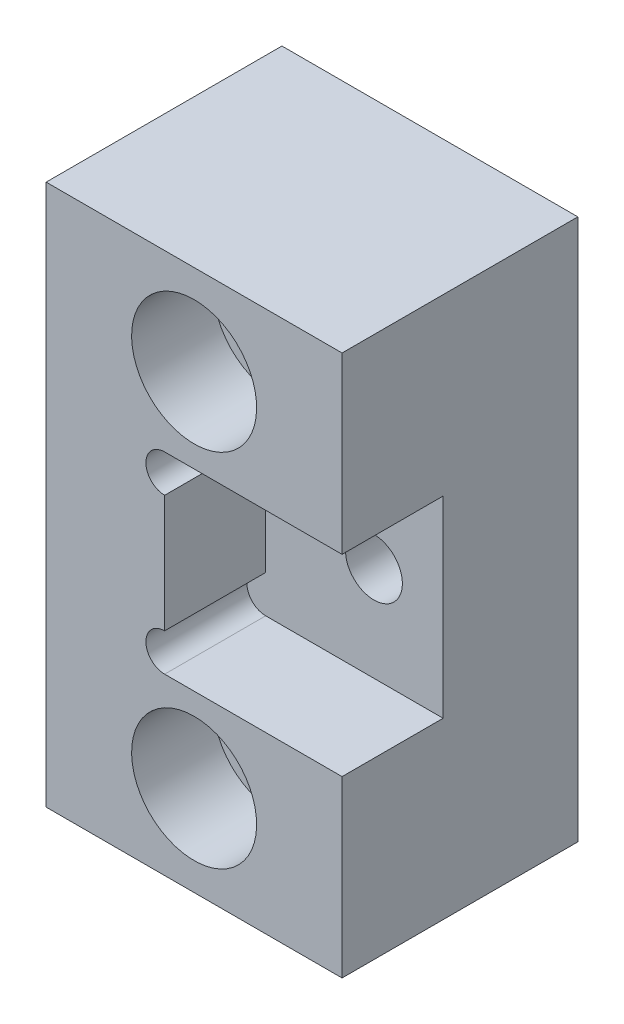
ISO-10303-21;
HEADER;
FILE_DESCRIPTION(('STEP AP214'),'2;1');
FILE_NAME('part.step','',(''),(''),'','','');
FILE_SCHEMA(('AUTOMOTIVE_DESIGN { 1 0 10303 214 1 1 1 1 }'));
ENDSEC;
DATA;
#1=APPLICATION_CONTEXT('core data for automotive mechanical design processes');
#2=APPLICATION_PROTOCOL_DEFINITION('international standard','automotive_design',2000,#1);
#3=PRODUCT_CONTEXT('',#1,'mechanical');
#4=PRODUCT('Part','Part','',(#3));
#5=PRODUCT_RELATED_PRODUCT_CATEGORY('part','',(#4));
#6=PRODUCT_DEFINITION_FORMATION('','',#4);
#7=PRODUCT_DEFINITION_CONTEXT('part definition',#1,'design');
#8=PRODUCT_DEFINITION('design','',#6,#7);
#9=PRODUCT_DEFINITION_SHAPE('','',#8);
#10=(LENGTH_UNIT() NAMED_UNIT(*) SI_UNIT(.MILLI.,.METRE.));
#11=(NAMED_UNIT(*) PLANE_ANGLE_UNIT() SI_UNIT($,.RADIAN.));
#12=(NAMED_UNIT(*) SI_UNIT($,.STERADIAN.) SOLID_ANGLE_UNIT());
#13=UNCERTAINTY_MEASURE_WITH_UNIT(LENGTH_MEASURE(1.E-05),#10,'distance_accuracy_value','');
#14=(GEOMETRIC_REPRESENTATION_CONTEXT(3) GLOBAL_UNCERTAINTY_ASSIGNED_CONTEXT((#13)) GLOBAL_UNIT_ASSIGNED_CONTEXT((#10,
#11,#12)) REPRESENTATION_CONTEXT('',''));
#15=CARTESIAN_POINT('',(0.,0.,0.));
#16=DIRECTION('',(0.,0.,1.));
#17=DIRECTION('',(1.,0.,0.));
#18=AXIS2_PLACEMENT_3D('',#15,#16,#17);
#19=CARTESIAN_POINT('',(15.621,47.625,24.892));
#20=DIRECTION('',(0.,0.,1.));
#21=DIRECTION('',(0.,1.,0.));
#22=AXIS2_PLACEMENT_3D('',#19,#20,#21);
#23=PLANE('',#22);
#24=CARTESIAN_POINT('',(0.,0.,24.892));
#25=DIRECTION('',(0.,0.,1.));
#26=DIRECTION('',(0.,1.,0.));
#27=AXIS2_PLACEMENT_3D('',#24,#25,#26);
#28=CIRCLE('',#27,6.6);
#29=CARTESIAN_POINT('',(0.,6.6,24.892));
#30=VERTEX_POINT('',#29);
#31=EDGE_CURVE('E179',#30,#30,#28,.F.);
#32=ORIENTED_EDGE('',*,*,#31,.T.);
#33=EDGE_LOOP('',(#32));
#34=FACE_BOUND('',#33,.T.);
#35=DIRECTION('',(0.,1.,0.));
#36=VECTOR('',#35,1.);
#37=CARTESIAN_POINT('',(15.621,-9.525,24.892));
#38=LINE('',#37,#36);
#39=CARTESIAN_POINT('',(15.621,-9.525,24.892));
#40=VERTEX_POINT('',#39);
#41=CARTESIAN_POINT('',(15.621,8.89,24.892));
#42=VERTEX_POINT('',#41);
#43=EDGE_CURVE('E147',#40,#42,#38,.T.);
#44=ORIENTED_EDGE('',*,*,#43,.T.);
#45=DIRECTION('',(-1.,0.,0.));
#46=VECTOR('',#45,1.);
#47=CARTESIAN_POINT('',(15.621,8.89,24.892));
#48=LINE('',#47,#46);
#49=CARTESIAN_POINT('',(-3.1115,8.89,24.892));
#50=VERTEX_POINT('',#49);
#51=EDGE_CURVE('E9',#42,#50,#48,.T.);
#52=ORIENTED_EDGE('',*,*,#51,.T.);
#53=CARTESIAN_POINT('',(-3.1115,10.8712,24.892));
#54=DIRECTION('',(0.,0.,1.));
#55=DIRECTION('',(0.,1.,0.));
#56=AXIS2_PLACEMENT_3D('',#53,#54,#55);
#57=CIRCLE('',#56,1.9812);
#58=CARTESIAN_POINT('',(-3.1115,12.8524,24.892));
#59=VERTEX_POINT('',#58);
#60=EDGE_CURVE('E105',#50,#59,#57,.F.);
#61=ORIENTED_EDGE('',*,*,#60,.T.);
#62=DIRECTION('',(0.,1.,0.));
#63=VECTOR('',#62,1.);
#64=CARTESIAN_POINT('',(-3.1115,47.625,24.892));
#65=LINE('',#64,#63);
#66=CARTESIAN_POINT('',(-3.1115,25.2476,24.892));
#67=VERTEX_POINT('',#66);
#68=EDGE_CURVE('E172',#59,#67,#65,.T.);
#69=ORIENTED_EDGE('',*,*,#68,.T.);
#70=CARTESIAN_POINT('',(-3.1115,27.2288,24.892));
#71=DIRECTION('',(0.,0.,1.));
#72=DIRECTION('',(0.,1.,0.));
#73=AXIS2_PLACEMENT_3D('',#70,#71,#72);
#74=CIRCLE('',#73,1.9812);
#75=CARTESIAN_POINT('',(-3.1115,29.21,24.892));
#76=VERTEX_POINT('',#75);
#77=EDGE_CURVE('E175',#67,#76,#74,.F.);
#78=ORIENTED_EDGE('',*,*,#77,.T.);
#79=DIRECTION('',(1.,0.,0.));
#80=VECTOR('',#79,1.);
#81=CARTESIAN_POINT('',(15.621,29.21,24.892));
#82=LINE('',#81,#80);
#83=CARTESIAN_POINT('',(15.621,29.21,24.892));
#84=VERTEX_POINT('',#83);
#85=EDGE_CURVE('E23',#76,#84,#82,.T.);
#86=ORIENTED_EDGE('',*,*,#85,.T.);
#87=CARTESIAN_POINT('',(15.621,47.625,24.892));
#88=VERTEX_POINT('',#87);
#89=EDGE_CURVE('E150',#84,#88,#38,.T.);
#90=ORIENTED_EDGE('',*,*,#89,.T.);
#91=DIRECTION('',(-1.,0.,0.));
#92=VECTOR('',#91,1.);
#93=CARTESIAN_POINT('',(15.621,47.625,24.892));
#94=LINE('',#93,#92);
#95=CARTESIAN_POINT('',(-15.621,47.625,24.892));
#96=VERTEX_POINT('',#95);
#97=EDGE_CURVE('E149',#88,#96,#94,.T.);
#98=ORIENTED_EDGE('',*,*,#97,.T.);
#99=DIRECTION('',(0.,-1.,0.));
#100=VECTOR('',#99,1.);
#101=CARTESIAN_POINT('',(-15.621,47.625,24.892));
#102=LINE('',#101,#100);
#103=CARTESIAN_POINT('',(-15.621,-9.525,24.892));
#104=VERTEX_POINT('',#103);
#105=EDGE_CURVE('E40',#96,#104,#102,.T.);
#106=ORIENTED_EDGE('',*,*,#105,.T.);
#107=DIRECTION('',(1.,0.,0.));
#108=VECTOR('',#107,1.);
#109=CARTESIAN_POINT('',(-15.621,-9.525,24.892));
#110=LINE('',#109,#108);
#111=EDGE_CURVE('E66',#104,#40,#110,.T.);
#112=ORIENTED_EDGE('',*,*,#111,.T.);
#113=EDGE_LOOP('',(#44,#52,#61,#69,#78,#86,#90,#98,#106,#112));
#114=FACE_BOUND('',#113,.T.);
#115=CARTESIAN_POINT('',(0.,38.1,24.892));
#116=DIRECTION('',(0.,0.,1.));
#117=DIRECTION('',(0.,1.,0.));
#118=AXIS2_PLACEMENT_3D('',#115,#116,#117);
#119=CIRCLE('',#118,6.6);
#120=CARTESIAN_POINT('',(0.,44.7,24.892));
#121=VERTEX_POINT('',#120);
#122=EDGE_CURVE('E18',#121,#121,#119,.F.);
#123=ORIENTED_EDGE('',*,*,#122,.T.);
#124=EDGE_LOOP('',(#123));
#125=FACE_BOUND('',#124,.T.);
#126=ADVANCED_FACE('F14',(#34,#114,#125),#23,.T.);
#127=CARTESIAN_POINT('',(15.621,-9.525,24.892));
#128=DIRECTION('',(-1.,0.,0.));
#129=DIRECTION('',(0.,-1.,0.));
#130=AXIS2_PLACEMENT_3D('',#127,#128,#129);
#131=PLANE('',#130);
#132=DIRECTION('',(0.,0.,-1.));
#133=VECTOR('',#132,1.);
#134=CARTESIAN_POINT('',(15.621,8.89,25.146));
#135=LINE('',#134,#133);
#136=CARTESIAN_POINT('',(15.621,8.89,14.224));
#137=VERTEX_POINT('',#136);
#138=EDGE_CURVE('E121',#42,#137,#135,.T.);
#139=ORIENTED_EDGE('',*,*,#138,.F.);
#140=ORIENTED_EDGE('',*,*,#43,.F.);
#141=DIRECTION('',(0.,0.,-1.));
#142=VECTOR('',#141,1.);
#143=CARTESIAN_POINT('',(15.621,-9.525,24.892));
#144=LINE('',#143,#142);
#145=CARTESIAN_POINT('',(15.621,-9.525,0.));
#146=VERTEX_POINT('',#145);
#147=EDGE_CURVE('E154',#40,#146,#144,.T.);
#148=ORIENTED_EDGE('',*,*,#147,.T.);
#149=DIRECTION('',(0.,1.,0.));
#150=VECTOR('',#149,1.);
#151=CARTESIAN_POINT('',(15.621,-9.525,0.));
#152=LINE('',#151,#150);
#153=CARTESIAN_POINT('',(15.621,47.625,0.));
#154=VERTEX_POINT('',#153);
#155=EDGE_CURVE('E145',#146,#154,#152,.T.);
#156=ORIENTED_EDGE('',*,*,#155,.T.);
#157=DIRECTION('',(0.,0.,-1.));
#158=VECTOR('',#157,1.);
#159=CARTESIAN_POINT('',(15.621,47.625,24.892));
#160=LINE('',#159,#158);
#161=EDGE_CURVE('E166',#88,#154,#160,.T.);
#162=ORIENTED_EDGE('',*,*,#161,.F.);
#163=ORIENTED_EDGE('',*,*,#89,.F.);
#164=DIRECTION('',(0.,0.,-1.));
#165=VECTOR('',#164,1.);
#166=CARTESIAN_POINT('',(15.621,29.21,25.146));
#167=LINE('',#166,#165);
#168=CARTESIAN_POINT('',(15.621,29.21,14.224));
#169=VERTEX_POINT('',#168);
#170=EDGE_CURVE('E142',#84,#169,#167,.T.);
#171=ORIENTED_EDGE('',*,*,#170,.T.);
#172=DIRECTION('',(0.,1.,0.));
#173=VECTOR('',#172,1.);
#174=CARTESIAN_POINT('',(15.621,8.89,14.224));
#175=LINE('',#174,#173);
#176=EDGE_CURVE('E122',#137,#169,#175,.T.);
#177=ORIENTED_EDGE('',*,*,#176,.F.);
#178=EDGE_LOOP('',(#139,#140,#148,#156,#162,#163,#171,#177));
#179=FACE_BOUND('',#178,.T.);
#180=ADVANCED_FACE('F16',(#179),#131,.F.);
#181=CARTESIAN_POINT('',(15.621,47.625,24.892));
#182=DIRECTION('',(0.,-1.,0.));
#183=DIRECTION('',(0.,0.,1.));
#184=AXIS2_PLACEMENT_3D('',#181,#182,#183);
#185=PLANE('',#184);
#186=DIRECTION('',(-1.,0.,0.));
#187=VECTOR('',#186,1.);
#188=CARTESIAN_POINT('',(15.621,47.625,0.));
#189=LINE('',#188,#187);
#190=CARTESIAN_POINT('',(-15.621,47.625,0.));
#191=VERTEX_POINT('',#190);
#192=EDGE_CURVE('E157',#154,#191,#189,.T.);
#193=ORIENTED_EDGE('',*,*,#192,.T.);
#194=DIRECTION('',(0.,0.,-1.));
#195=VECTOR('',#194,1.);
#196=CARTESIAN_POINT('',(-15.621,47.625,24.892));
#197=LINE('',#196,#195);
#198=EDGE_CURVE('E164',#96,#191,#197,.T.);
#199=ORIENTED_EDGE('',*,*,#198,.F.);
#200=ORIENTED_EDGE('',*,*,#97,.F.);
#201=ORIENTED_EDGE('',*,*,#161,.T.);
#202=EDGE_LOOP('',(#193,#199,#200,#201));
#203=FACE_BOUND('',#202,.T.);
#204=ADVANCED_FACE('F230',(#203),#185,.F.);
#205=CARTESIAN_POINT('',(-15.621,47.625,24.892));
#206=DIRECTION('',(1.,0.,0.));
#207=DIRECTION('',(0.,0.,-1.));
#208=AXIS2_PLACEMENT_3D('',#205,#206,#207);
#209=PLANE('',#208);
#210=DIRECTION('',(0.,-1.,0.));
#211=VECTOR('',#210,1.);
#212=CARTESIAN_POINT('',(-15.621,47.625,0.));
#213=LINE('',#212,#211);
#214=CARTESIAN_POINT('',(-15.621,-9.525,0.));
#215=VERTEX_POINT('',#214);
#216=EDGE_CURVE('E61',#191,#215,#213,.T.);
#217=ORIENTED_EDGE('',*,*,#216,.T.);
#218=DIRECTION('',(0.,0.,-1.));
#219=VECTOR('',#218,1.);
#220=CARTESIAN_POINT('',(-15.621,-9.525,24.892));
#221=LINE('',#220,#219);
#222=EDGE_CURVE('E162',#104,#215,#221,.T.);
#223=ORIENTED_EDGE('',*,*,#222,.F.);
#224=ORIENTED_EDGE('',*,*,#105,.F.);
#225=ORIENTED_EDGE('',*,*,#198,.T.);
#226=EDGE_LOOP('',(#217,#223,#224,#225));
#227=FACE_BOUND('',#226,.T.);
#228=ADVANCED_FACE('F242',(#227),#209,.F.);
#229=CARTESIAN_POINT('',(-15.621,-9.525,24.892));
#230=DIRECTION('',(0.,1.,0.));
#231=DIRECTION('',(-1.,0.,0.));
#232=AXIS2_PLACEMENT_3D('',#229,#230,#231);
#233=PLANE('',#232);
#234=DIRECTION('',(1.,0.,0.));
#235=VECTOR('',#234,1.);
#236=CARTESIAN_POINT('',(-15.621,-9.525,0.));
#237=LINE('',#236,#235);
#238=EDGE_CURVE('E160',#215,#146,#237,.T.);
#239=ORIENTED_EDGE('',*,*,#238,.T.);
#240=ORIENTED_EDGE('',*,*,#147,.F.);
#241=ORIENTED_EDGE('',*,*,#111,.F.);
#242=ORIENTED_EDGE('',*,*,#222,.T.);
#243=EDGE_LOOP('',(#239,#240,#241,#242));
#244=FACE_BOUND('',#243,.T.);
#245=ADVANCED_FACE('F238',(#244),#233,.F.);
#246=CARTESIAN_POINT('',(15.621,47.625,0.));
#247=DIRECTION('',(0.,0.,1.));
#248=DIRECTION('',(0.,1.,0.));
#249=AXIS2_PLACEMENT_3D('',#246,#247,#248);
#250=PLANE('',#249);
#251=CARTESIAN_POINT('',(0.,0.,0.));
#252=DIRECTION('',(0.,0.,1.));
#253=DIRECTION('',(0.,1.,0.));
#254=AXIS2_PLACEMENT_3D('',#251,#252,#253);
#255=CIRCLE('',#254,4.1);
#256=CARTESIAN_POINT('',(0.,4.1,0.));
#257=VERTEX_POINT('',#256);
#258=EDGE_CURVE('E186',#257,#257,#255,.T.);
#259=ORIENTED_EDGE('',*,*,#258,.T.);
#260=EDGE_LOOP('',(#259));
#261=FACE_BOUND('',#260,.T.);
#262=CARTESIAN_POINT('',(0.,38.1,0.));
#263=DIRECTION('',(0.,0.,1.));
#264=DIRECTION('',(0.,1.,0.));
#265=AXIS2_PLACEMENT_3D('',#262,#263,#264);
#266=CIRCLE('',#265,4.1);
#267=CARTESIAN_POINT('',(0.,42.2,0.));
#268=VERTEX_POINT('',#267);
#269=EDGE_CURVE('E201',#268,#268,#266,.T.);
#270=ORIENTED_EDGE('',*,*,#269,.T.);
#271=EDGE_LOOP('',(#270));
#272=FACE_BOUND('',#271,.T.);
#273=CARTESIAN_POINT('',(8.3185,19.05,0.));
#274=DIRECTION('',(0.,0.,1.));
#275=DIRECTION('',(0.,1.,0.));
#276=AXIS2_PLACEMENT_3D('',#273,#274,#275);
#277=CIRCLE('',#276,3.);
#278=CARTESIAN_POINT('',(8.3185,22.05,0.));
#279=VERTEX_POINT('',#278);
#280=EDGE_CURVE('E123',#279,#279,#277,.T.);
#281=ORIENTED_EDGE('',*,*,#280,.T.);
#282=EDGE_LOOP('',(#281));
#283=FACE_BOUND('',#282,.T.);
#284=ORIENTED_EDGE('',*,*,#155,.F.);
#285=ORIENTED_EDGE('',*,*,#238,.F.);
#286=ORIENTED_EDGE('',*,*,#216,.F.);
#287=ORIENTED_EDGE('',*,*,#192,.F.);
#288=EDGE_LOOP('',(#284,#285,#286,#287));
#289=FACE_BOUND('',#288,.T.);
#290=ADVANCED_FACE('F235',(#261,#272,#283,#289),#250,.F.);
#291=CARTESIAN_POINT('',(-3.1115,8.89,25.146));
#292=DIRECTION('',(0.,1.,0.));
#293=DIRECTION('',(0.,0.,-1.));
#294=AXIS2_PLACEMENT_3D('',#291,#292,#293);
#295=PLANE('',#294);
#296=ORIENTED_EDGE('',*,*,#138,.T.);
#297=DIRECTION('',(1.,0.,0.));
#298=VECTOR('',#297,1.);
#299=CARTESIAN_POINT('',(-3.1115,8.89,14.224));
#300=LINE('',#299,#298);
#301=CARTESIAN_POINT('',(-3.1115,8.89,14.224));
#302=VERTEX_POINT('',#301);
#303=EDGE_CURVE('E113',#302,#137,#300,.T.);
#304=ORIENTED_EDGE('',*,*,#303,.F.);
#305=DIRECTION('',(0.,0.,-1.));
#306=VECTOR('',#305,1.);
#307=CARTESIAN_POINT('',(-3.1115,8.89,25.146));
#308=LINE('',#307,#306);
#309=EDGE_CURVE('E100',#50,#302,#308,.T.);
#310=ORIENTED_EDGE('',*,*,#309,.F.);
#311=ORIENTED_EDGE('',*,*,#51,.F.);
#312=EDGE_LOOP('',(#296,#304,#310,#311));
#313=FACE_BOUND('',#312,.T.);
#314=ADVANCED_FACE('F119',(#313),#295,.T.);
#315=CARTESIAN_POINT('',(15.621,29.21,25.146));
#316=DIRECTION('',(0.,-1.,0.));
#317=DIRECTION('',(0.,0.,1.));
#318=AXIS2_PLACEMENT_3D('',#315,#316,#317);
#319=PLANE('',#318);
#320=DIRECTION('',(0.,0.,-1.));
#321=VECTOR('',#320,1.);
#322=CARTESIAN_POINT('',(-3.1115,29.21,25.146));
#323=LINE('',#322,#321);
#324=CARTESIAN_POINT('',(-3.1115,29.21,14.224));
#325=VERTEX_POINT('',#324);
#326=EDGE_CURVE('E140',#76,#325,#323,.T.);
#327=ORIENTED_EDGE('',*,*,#326,.T.);
#328=DIRECTION('',(-1.,0.,0.));
#329=VECTOR('',#328,1.);
#330=CARTESIAN_POINT('',(15.621,29.21,14.224));
#331=LINE('',#330,#329);
#332=EDGE_CURVE('E125',#169,#325,#331,.T.);
#333=ORIENTED_EDGE('',*,*,#332,.F.);
#334=ORIENTED_EDGE('',*,*,#170,.F.);
#335=ORIENTED_EDGE('',*,*,#85,.F.);
#336=EDGE_LOOP('',(#327,#333,#334,#335));
#337=FACE_BOUND('',#336,.T.);
#338=ADVANCED_FACE('F266',(#337),#319,.T.);
#339=CARTESIAN_POINT('',(-3.1115,27.2288,25.146));
#340=DIRECTION('',(0.,0.,-1.));
#341=DIRECTION('',(0.,-1.,0.));
#342=AXIS2_PLACEMENT_3D('',#339,#340,#341);
#343=CYLINDRICAL_SURFACE('',#342,1.9812);
#344=DIRECTION('',(0.,0.,-1.));
#345=VECTOR('',#344,1.);
#346=CARTESIAN_POINT('',(-3.1115,25.2476,25.146));
#347=LINE('',#346,#345);
#348=CARTESIAN_POINT('',(-3.1115,25.2476,14.224));
#349=VERTEX_POINT('',#348);
#350=EDGE_CURVE('E138',#67,#349,#347,.T.);
#351=ORIENTED_EDGE('',*,*,#350,.T.);
#352=CARTESIAN_POINT('',(-3.1115,27.2288,14.224));
#353=DIRECTION('',(0.,0.,1.));
#354=DIRECTION('',(0.,1.,0.));
#355=AXIS2_PLACEMENT_3D('',#352,#353,#354);
#356=CIRCLE('',#355,1.9812);
#357=EDGE_CURVE('E134',#325,#349,#356,.T.);
#358=ORIENTED_EDGE('',*,*,#357,.F.);
#359=ORIENTED_EDGE('',*,*,#326,.F.);
#360=ORIENTED_EDGE('',*,*,#77,.F.);
#361=EDGE_LOOP('',(#351,#358,#359,#360));
#362=FACE_BOUND('',#361,.T.);
#363=ADVANCED_FACE('F262',(#362),#343,.F.);
#364=CARTESIAN_POINT('',(-3.1115,25.2476,25.146));
#365=DIRECTION('',(1.,0.,0.));
#366=DIRECTION('',(0.,0.,-1.));
#367=AXIS2_PLACEMENT_3D('',#364,#365,#366);
#368=PLANE('',#367);
#369=DIRECTION('',(0.,0.,-1.));
#370=VECTOR('',#369,1.);
#371=CARTESIAN_POINT('',(-3.1115,12.8524,25.146));
#372=LINE('',#371,#370);
#373=CARTESIAN_POINT('',(-3.1115,12.8524,14.224));
#374=VERTEX_POINT('',#373);
#375=EDGE_CURVE('E31',#59,#374,#372,.T.);
#376=ORIENTED_EDGE('',*,*,#375,.T.);
#377=DIRECTION('',(0.,-1.,0.));
#378=VECTOR('',#377,1.);
#379=CARTESIAN_POINT('',(-3.1115,25.2476,14.224));
#380=LINE('',#379,#378);
#381=EDGE_CURVE('E117',#349,#374,#380,.T.);
#382=ORIENTED_EDGE('',*,*,#381,.F.);
#383=ORIENTED_EDGE('',*,*,#350,.F.);
#384=ORIENTED_EDGE('',*,*,#68,.F.);
#385=EDGE_LOOP('',(#376,#382,#383,#384));
#386=FACE_BOUND('',#385,.T.);
#387=ADVANCED_FACE('F222',(#386),#368,.T.);
#388=CARTESIAN_POINT('',(-3.1115,10.8712,25.146));
#389=DIRECTION('',(0.,0.,-1.));
#390=DIRECTION('',(0.,-1.,0.));
#391=AXIS2_PLACEMENT_3D('',#388,#389,#390);
#392=CYLINDRICAL_SURFACE('',#391,1.9812);
#393=ORIENTED_EDGE('',*,*,#309,.T.);
#394=CARTESIAN_POINT('',(-3.1115,10.8712,14.224));
#395=DIRECTION('',(0.,0.,1.));
#396=DIRECTION('',(0.,1.,0.));
#397=AXIS2_PLACEMENT_3D('',#394,#395,#396);
#398=CIRCLE('',#397,1.9812);
#399=EDGE_CURVE('E103',#374,#302,#398,.T.);
#400=ORIENTED_EDGE('',*,*,#399,.F.);
#401=ORIENTED_EDGE('',*,*,#375,.F.);
#402=ORIENTED_EDGE('',*,*,#60,.F.);
#403=EDGE_LOOP('',(#393,#400,#401,#402));
#404=FACE_BOUND('',#403,.T.);
#405=ADVANCED_FACE('F102',(#404),#392,.F.);
#406=CARTESIAN_POINT('',(-3.1115,27.2288,14.224));
#407=DIRECTION('',(0.,0.,1.));
#408=DIRECTION('',(0.,1.,0.));
#409=AXIS2_PLACEMENT_3D('',#406,#407,#408);
#410=PLANE('',#409);
#411=CARTESIAN_POINT('',(8.3185,19.05,14.224));
#412=DIRECTION('',(0.,0.,1.));
#413=DIRECTION('',(0.,1.,0.));
#414=AXIS2_PLACEMENT_3D('',#411,#412,#413);
#415=CIRCLE('',#414,3.);
#416=CARTESIAN_POINT('',(8.3185,22.05,14.224));
#417=VERTEX_POINT('',#416);
#418=EDGE_CURVE('E128',#417,#417,#415,.T.);
#419=ORIENTED_EDGE('',*,*,#418,.F.);
#420=EDGE_LOOP('',(#419));
#421=FACE_BOUND('',#420,.T.);
#422=ORIENTED_EDGE('',*,*,#303,.T.);
#423=ORIENTED_EDGE('',*,*,#176,.T.);
#424=ORIENTED_EDGE('',*,*,#332,.T.);
#425=ORIENTED_EDGE('',*,*,#357,.T.);
#426=ORIENTED_EDGE('',*,*,#381,.T.);
#427=ORIENTED_EDGE('',*,*,#399,.T.);
#428=EDGE_LOOP('',(#422,#423,#424,#425,#426,#427));
#429=FACE_BOUND('',#428,.T.);
#430=ADVANCED_FACE('F112',(#421,#429),#410,.T.);
#431=CARTESIAN_POINT('',(0.,0.,16.256));
#432=DIRECTION('',(0.,0.,-1.));
#433=DIRECTION('',(0.,-1.,0.));
#434=AXIS2_PLACEMENT_3D('',#431,#432,#433);
#435=PLANE('',#434);
#436=CARTESIAN_POINT('',(0.,0.,16.256));
#437=DIRECTION('',(0.,0.,1.));
#438=DIRECTION('',(0.,1.,0.));
#439=AXIS2_PLACEMENT_3D('',#436,#437,#438);
#440=CIRCLE('',#439,4.1);
#441=CARTESIAN_POINT('',(0.,4.1,16.256));
#442=VERTEX_POINT('',#441);
#443=EDGE_CURVE('E181',#442,#442,#440,.T.);
#444=ORIENTED_EDGE('',*,*,#443,.F.);
#445=EDGE_LOOP('',(#444));
#446=FACE_BOUND('',#445,.T.);
#447=CARTESIAN_POINT('',(0.,0.,16.256));
#448=DIRECTION('',(0.,0.,1.));
#449=DIRECTION('',(0.,1.,0.));
#450=AXIS2_PLACEMENT_3D('',#447,#448,#449);
#451=CIRCLE('',#450,6.6);
#452=CARTESIAN_POINT('',(0.,6.6,16.256));
#453=VERTEX_POINT('',#452);
#454=EDGE_CURVE('E182',#453,#453,#451,.T.);
#455=ORIENTED_EDGE('',*,*,#454,.T.);
#456=EDGE_LOOP('',(#455));
#457=FACE_BOUND('',#456,.T.);
#458=ADVANCED_FACE('F211',(#446,#457),#435,.F.);
#459=CARTESIAN_POINT('',(0.,38.1,16.256));
#460=DIRECTION('',(0.,0.,-1.));
#461=DIRECTION('',(0.,-1.,0.));
#462=AXIS2_PLACEMENT_3D('',#459,#460,#461);
#463=PLANE('',#462);
#464=CARTESIAN_POINT('',(0.,38.1,16.256));
#465=DIRECTION('',(0.,0.,1.));
#466=DIRECTION('',(0.,1.,0.));
#467=AXIS2_PLACEMENT_3D('',#464,#465,#466);
#468=CIRCLE('',#467,4.1);
#469=CARTESIAN_POINT('',(0.,42.2,16.256));
#470=VERTEX_POINT('',#469);
#471=EDGE_CURVE('E198',#470,#470,#468,.T.);
#472=ORIENTED_EDGE('',*,*,#471,.F.);
#473=EDGE_LOOP('',(#472));
#474=FACE_BOUND('',#473,.T.);
#475=CARTESIAN_POINT('',(0.,38.1,16.256));
#476=DIRECTION('',(0.,0.,1.));
#477=DIRECTION('',(0.,1.,0.));
#478=AXIS2_PLACEMENT_3D('',#475,#476,#477);
#479=CIRCLE('',#478,6.6);
#480=CARTESIAN_POINT('',(0.,44.7,16.256));
#481=VERTEX_POINT('',#480);
#482=EDGE_CURVE('E193',#481,#481,#479,.T.);
#483=ORIENTED_EDGE('',*,*,#482,.T.);
#484=EDGE_LOOP('',(#483));
#485=FACE_BOUND('',#484,.T.);
#486=ADVANCED_FACE('F219',(#474,#485),#463,.F.);
#487=CARTESIAN_POINT('',(8.3185,19.05,0.));
#488=DIRECTION('',(0.,0.,1.));
#489=DIRECTION('',(0.,1.,0.));
#490=AXIS2_PLACEMENT_3D('',#487,#488,#489);
#491=CYLINDRICAL_SURFACE('',#490,3.);
#492=ORIENTED_EDGE('',*,*,#280,.F.);
#493=EDGE_LOOP('',(#492));
#494=FACE_BOUND('',#493,.T.);
#495=ORIENTED_EDGE('',*,*,#418,.T.);
#496=EDGE_LOOP('',(#495));
#497=FACE_BOUND('',#496,.T.);
#498=ADVANCED_FACE('F208',(#494,#497),#491,.F.);
#499=CARTESIAN_POINT('',(0.,38.1,-4.744));
#500=DIRECTION('',(0.,0.,1.));
#501=DIRECTION('',(0.,1.,0.));
#502=AXIS2_PLACEMENT_3D('',#499,#500,#501);
#503=CYLINDRICAL_SURFACE('',#502,4.1);
#504=ORIENTED_EDGE('',*,*,#471,.T.);
#505=EDGE_LOOP('',(#504));
#506=FACE_BOUND('',#505,.T.);
#507=ORIENTED_EDGE('',*,*,#269,.F.);
#508=EDGE_LOOP('',(#507));
#509=FACE_BOUND('',#508,.T.);
#510=ADVANCED_FACE('F363',(#506,#509),#503,.F.);
#511=CARTESIAN_POINT('',(0.,0.,-4.744));
#512=DIRECTION('',(0.,0.,1.));
#513=DIRECTION('',(0.,1.,0.));
#514=AXIS2_PLACEMENT_3D('',#511,#512,#513);
#515=CYLINDRICAL_SURFACE('',#514,4.1);
#516=ORIENTED_EDGE('',*,*,#443,.T.);
#517=EDGE_LOOP('',(#516));
#518=FACE_BOUND('',#517,.T.);
#519=ORIENTED_EDGE('',*,*,#258,.F.);
#520=EDGE_LOOP('',(#519));
#521=FACE_BOUND('',#520,.T.);
#522=ADVANCED_FACE('F372',(#518,#521),#515,.F.);
#523=CARTESIAN_POINT('',(0.,0.,27.256));
#524=DIRECTION('',(0.,0.,-1.));
#525=DIRECTION('',(0.,-1.,0.));
#526=AXIS2_PLACEMENT_3D('',#523,#524,#525);
#527=CYLINDRICAL_SURFACE('',#526,6.6);
#528=ORIENTED_EDGE('',*,*,#31,.F.);
#529=EDGE_LOOP('',(#528));
#530=FACE_BOUND('',#529,.T.);
#531=ORIENTED_EDGE('',*,*,#454,.F.);
#532=EDGE_LOOP('',(#531));
#533=FACE_BOUND('',#532,.T.);
#534=ADVANCED_FACE('F381',(#530,#533),#527,.F.);
#535=CARTESIAN_POINT('',(0.,38.1,27.256));
#536=DIRECTION('',(0.,0.,-1.));
#537=DIRECTION('',(0.,-1.,0.));
#538=AXIS2_PLACEMENT_3D('',#535,#536,#537);
#539=CYLINDRICAL_SURFACE('',#538,6.6);
#540=ORIENTED_EDGE('',*,*,#122,.F.);
#541=EDGE_LOOP('',(#540));
#542=FACE_BOUND('',#541,.T.);
#543=ORIENTED_EDGE('',*,*,#482,.F.);
#544=EDGE_LOOP('',(#543));
#545=FACE_BOUND('',#544,.T.);
#546=ADVANCED_FACE('F390',(#542,#545),#539,.F.);
#547=CLOSED_SHELL('',(#126,#180,#204,#228,#245,#290,#314,#338,#363,#387,#405,#430,#458,#486,
#498,#510,#522,#534,#546));
#548=MANIFOLD_SOLID_BREP('B1',#547);
#549=ADVANCED_BREP_SHAPE_REPRESENTATION('',(#18,#548),#14);
#550=SHAPE_DEFINITION_REPRESENTATION(#9,#549);
ENDSEC;
END-ISO-10303-21;
